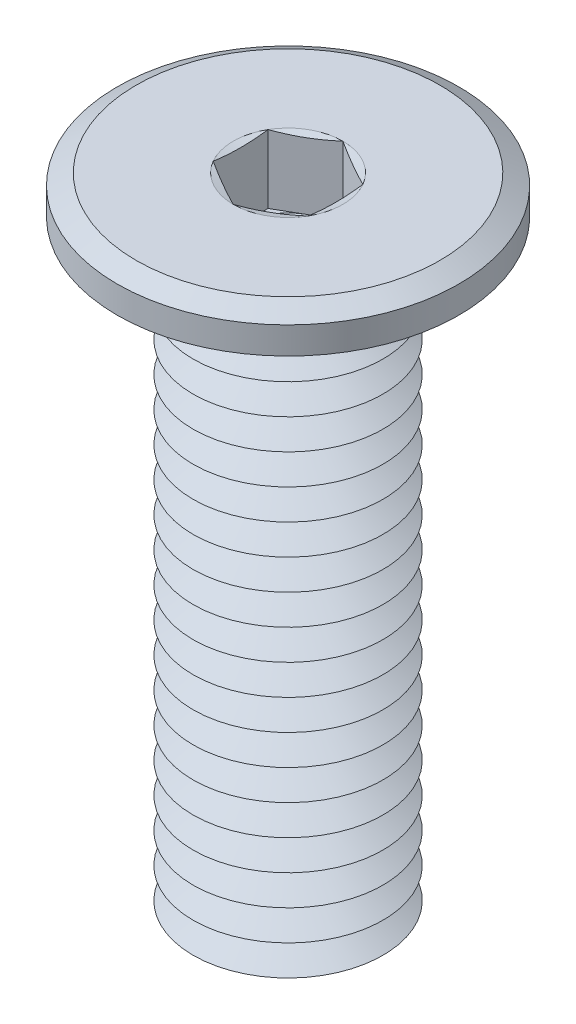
ISO-10303-21;
HEADER;
FILE_DESCRIPTION(('STEP AP214'),'2;1');
FILE_NAME('part.step','',(''),(''),'','','');
FILE_SCHEMA(('AUTOMOTIVE_DESIGN { 1 0 10303 214 1 1 1 1 }'));
ENDSEC;
DATA;
#1=APPLICATION_CONTEXT('core data for automotive mechanical design processes');
#2=APPLICATION_PROTOCOL_DEFINITION('international standard','automotive_design',2000,#1);
#3=PRODUCT_CONTEXT('',#1,'mechanical');
#4=PRODUCT('Part','Part','',(#3));
#5=PRODUCT_RELATED_PRODUCT_CATEGORY('part','',(#4));
#6=PRODUCT_DEFINITION_FORMATION('','',#4);
#7=PRODUCT_DEFINITION_CONTEXT('part definition',#1,'design');
#8=PRODUCT_DEFINITION('design','',#6,#7);
#9=PRODUCT_DEFINITION_SHAPE('','',#8);
#10=(LENGTH_UNIT() NAMED_UNIT(*) SI_UNIT(.MILLI.,.METRE.));
#11=(NAMED_UNIT(*) PLANE_ANGLE_UNIT() SI_UNIT($,.RADIAN.));
#12=(NAMED_UNIT(*) SI_UNIT($,.STERADIAN.) SOLID_ANGLE_UNIT());
#13=UNCERTAINTY_MEASURE_WITH_UNIT(LENGTH_MEASURE(1.E-05),#10,'distance_accuracy_value','');
#14=(GEOMETRIC_REPRESENTATION_CONTEXT(3) GLOBAL_UNCERTAINTY_ASSIGNED_CONTEXT((#13)) GLOBAL_UNIT_ASSIGNED_CONTEXT((#10,
#11,#12)) REPRESENTATION_CONTEXT('',''));
#15=CARTESIAN_POINT('',(0.,0.,0.));
#16=DIRECTION('',(0.,0.,1.));
#17=DIRECTION('',(1.,0.,0.));
#18=AXIS2_PLACEMENT_3D('',#15,#16,#17);
#19=CARTESIAN_POINT('',(0.,-15.8,0.));
#20=DIRECTION('',(0.,-1.,0.));
#21=DIRECTION('',(0.,0.,-1.));
#22=AXIS2_PLACEMENT_3D('',#19,#20,#21);
#23=CONICAL_SURFACE('',#22,2.5,1.0471975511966);
#24=CARTESIAN_POINT('',(0.,-15.4,0.));
#25=DIRECTION('',(0.,1.,0.));
#26=DIRECTION('',(0.,0.,1.));
#27=AXIS2_PLACEMENT_3D('',#24,#25,#26);
#28=CIRCLE('',#27,1.80717967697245);
#29=CARTESIAN_POINT('',(0.,-15.4,1.80717967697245));
#30=VERTEX_POINT('',#29);
#31=EDGE_CURVE('E503',#30,#30,#28,.T.);
#32=ORIENTED_EDGE('',*,*,#31,.F.);
#33=EDGE_LOOP('',(#32));
#34=FACE_BOUND('',#33,.T.);
#35=CARTESIAN_POINT('',(0.,-15.8,0.));
#36=DIRECTION('',(0.,1.,0.));
#37=DIRECTION('',(0.,0.,1.));
#38=AXIS2_PLACEMENT_3D('',#35,#36,#37);
#39=CIRCLE('',#38,2.5);
#40=CARTESIAN_POINT('',(0.,-15.8,2.5));
#41=VERTEX_POINT('',#40);
#42=EDGE_CURVE('E507',#41,#41,#39,.T.);
#43=ORIENTED_EDGE('',*,*,#42,.T.);
#44=EDGE_LOOP('',(#43));
#45=FACE_BOUND('',#44,.T.);
#46=ADVANCED_FACE('F39',(#34,#45),#23,.T.);
#47=CARTESIAN_POINT('',(0.,-15.4,0.));
#48=DIRECTION('',(0.,1.,0.));
#49=DIRECTION('',(0.,0.,1.));
#50=AXIS2_PLACEMENT_3D('',#47,#48,#49);
#51=CONICAL_SURFACE('',#50,1.80717967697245,1.0471975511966);
#52=CARTESIAN_POINT('',(0.,-15.,0.));
#53=DIRECTION('',(0.,1.,0.));
#54=DIRECTION('',(0.,0.,1.));
#55=AXIS2_PLACEMENT_3D('',#52,#53,#54);
#56=CIRCLE('',#55,2.5);
#57=CARTESIAN_POINT('',(0.,-15.,2.5));
#58=VERTEX_POINT('',#57);
#59=EDGE_CURVE('E499',#58,#58,#56,.T.);
#60=ORIENTED_EDGE('',*,*,#59,.F.);
#61=EDGE_LOOP('',(#60));
#62=FACE_BOUND('',#61,.T.);
#63=ORIENTED_EDGE('',*,*,#31,.T.);
#64=EDGE_LOOP('',(#63));
#65=FACE_BOUND('',#64,.T.);
#66=ADVANCED_FACE('F233',(#62,#65),#51,.T.);
#67=CARTESIAN_POINT('',(0.,-17.,0.));
#68=DIRECTION('',(0.,-1.,0.));
#69=DIRECTION('',(0.,0.,-1.));
#70=AXIS2_PLACEMENT_3D('',#67,#68,#69);
#71=PLANE('',#70);
#72=CARTESIAN_POINT('',(0.,-17.,0.));
#73=DIRECTION('',(0.,1.,0.));
#74=DIRECTION('',(0.,0.,1.));
#75=AXIS2_PLACEMENT_3D('',#72,#73,#74);
#76=CIRCLE('',#75,1.80717967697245);
#77=CARTESIAN_POINT('',(0.,-17.,1.80717967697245));
#78=VERTEX_POINT('',#77);
#79=EDGE_CURVE('E300',#78,#78,#76,.T.);
#80=ORIENTED_EDGE('',*,*,#79,.F.);
#81=EDGE_LOOP('',(#80));
#82=FACE_BOUND('',#81,.T.);
#83=ADVANCED_FACE('F239',(#82),#71,.T.);
#84=CARTESIAN_POINT('',(0.,-17.,0.));
#85=DIRECTION('',(0.,1.,0.));
#86=DIRECTION('',(0.,0.,1.));
#87=AXIS2_PLACEMENT_3D('',#84,#85,#86);
#88=CONICAL_SURFACE('',#87,1.80717967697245,1.0471975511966);
#89=CARTESIAN_POINT('',(0.,-16.6,0.));
#90=DIRECTION('',(0.,1.,0.));
#91=DIRECTION('',(0.,0.,1.));
#92=AXIS2_PLACEMENT_3D('',#89,#90,#91);
#93=CIRCLE('',#92,2.5);
#94=CARTESIAN_POINT('',(0.,-16.6,2.5));
#95=VERTEX_POINT('',#94);
#96=EDGE_CURVE('E515',#95,#95,#93,.T.);
#97=ORIENTED_EDGE('',*,*,#96,.F.);
#98=EDGE_LOOP('',(#97));
#99=FACE_BOUND('',#98,.T.);
#100=ORIENTED_EDGE('',*,*,#79,.T.);
#101=EDGE_LOOP('',(#100));
#102=FACE_BOUND('',#101,.T.);
#103=ADVANCED_FACE('F254',(#99,#102),#88,.T.);
#104=CARTESIAN_POINT('',(0.,-16.6,0.));
#105=DIRECTION('',(0.,-1.,0.));
#106=DIRECTION('',(0.,0.,-1.));
#107=AXIS2_PLACEMENT_3D('',#104,#105,#106);
#108=CONICAL_SURFACE('',#107,2.5,1.0471975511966);
#109=CARTESIAN_POINT('',(0.,-16.2,0.));
#110=DIRECTION('',(0.,1.,0.));
#111=DIRECTION('',(0.,0.,1.));
#112=AXIS2_PLACEMENT_3D('',#109,#110,#111);
#113=CIRCLE('',#112,1.80717967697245);
#114=CARTESIAN_POINT('',(0.,-16.2,1.80717967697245));
#115=VERTEX_POINT('',#114);
#116=EDGE_CURVE('E511',#115,#115,#113,.T.);
#117=ORIENTED_EDGE('',*,*,#116,.F.);
#118=EDGE_LOOP('',(#117));
#119=FACE_BOUND('',#118,.T.);
#120=ORIENTED_EDGE('',*,*,#96,.T.);
#121=EDGE_LOOP('',(#120));
#122=FACE_BOUND('',#121,.T.);
#123=ADVANCED_FACE('F250',(#119,#122),#108,.T.);
#124=CARTESIAN_POINT('',(0.,-16.2,0.));
#125=DIRECTION('',(0.,1.,0.));
#126=DIRECTION('',(0.,0.,1.));
#127=AXIS2_PLACEMENT_3D('',#124,#125,#126);
#128=CONICAL_SURFACE('',#127,1.80717967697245,1.0471975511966);
#129=ORIENTED_EDGE('',*,*,#42,.F.);
#130=EDGE_LOOP('',(#129));
#131=FACE_BOUND('',#130,.T.);
#132=ORIENTED_EDGE('',*,*,#116,.T.);
#133=EDGE_LOOP('',(#132));
#134=FACE_BOUND('',#133,.T.);
#135=ADVANCED_FACE('F246',(#131,#134),#128,.T.);
#136=CARTESIAN_POINT('',(0.,-15.,0.));
#137=DIRECTION('',(0.,-1.,0.));
#138=DIRECTION('',(0.,0.,-1.));
#139=AXIS2_PLACEMENT_3D('',#136,#137,#138);
#140=CONICAL_SURFACE('',#139,2.5,1.0471975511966);
#141=CARTESIAN_POINT('',(0.,-14.6,0.));
#142=DIRECTION('',(0.,1.,0.));
#143=DIRECTION('',(0.,0.,1.));
#144=AXIS2_PLACEMENT_3D('',#141,#142,#143);
#145=CIRCLE('',#144,1.80717967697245);
#146=CARTESIAN_POINT('',(0.,-14.6,1.80717967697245));
#147=VERTEX_POINT('',#146);
#148=EDGE_CURVE('E495',#147,#147,#145,.T.);
#149=ORIENTED_EDGE('',*,*,#148,.F.);
#150=EDGE_LOOP('',(#149));
#151=FACE_BOUND('',#150,.T.);
#152=ORIENTED_EDGE('',*,*,#59,.T.);
#153=EDGE_LOOP('',(#152));
#154=FACE_BOUND('',#153,.T.);
#155=ADVANCED_FACE('F249',(#151,#154),#140,.T.);
#156=CARTESIAN_POINT('',(0.,-14.6,0.));
#157=DIRECTION('',(0.,1.,0.));
#158=DIRECTION('',(0.,0.,1.));
#159=AXIS2_PLACEMENT_3D('',#156,#157,#158);
#160=CONICAL_SURFACE('',#159,1.80717967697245,1.0471975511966);
#161=CARTESIAN_POINT('',(0.,-14.2,0.));
#162=DIRECTION('',(0.,1.,0.));
#163=DIRECTION('',(0.,0.,1.));
#164=AXIS2_PLACEMENT_3D('',#161,#162,#163);
#165=CIRCLE('',#164,2.5);
#166=CARTESIAN_POINT('',(0.,-14.2,2.5));
#167=VERTEX_POINT('',#166);
#168=EDGE_CURVE('E491',#167,#167,#165,.T.);
#169=ORIENTED_EDGE('',*,*,#168,.F.);
#170=EDGE_LOOP('',(#169));
#171=FACE_BOUND('',#170,.T.);
#172=ORIENTED_EDGE('',*,*,#148,.T.);
#173=EDGE_LOOP('',(#172));
#174=FACE_BOUND('',#173,.T.);
#175=ADVANCED_FACE('F700',(#171,#174),#160,.T.);
#176=CARTESIAN_POINT('',(0.,-14.2,0.));
#177=DIRECTION('',(0.,-1.,0.));
#178=DIRECTION('',(0.,0.,-1.));
#179=AXIS2_PLACEMENT_3D('',#176,#177,#178);
#180=CONICAL_SURFACE('',#179,2.5,1.0471975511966);
#181=CARTESIAN_POINT('',(0.,-13.8,0.));
#182=DIRECTION('',(0.,1.,0.));
#183=DIRECTION('',(0.,0.,1.));
#184=AXIS2_PLACEMENT_3D('',#181,#182,#183);
#185=CIRCLE('',#184,1.80717967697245);
#186=CARTESIAN_POINT('',(0.,-13.8,1.80717967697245));
#187=VERTEX_POINT('',#186);
#188=EDGE_CURVE('E487',#187,#187,#185,.T.);
#189=ORIENTED_EDGE('',*,*,#188,.F.);
#190=EDGE_LOOP('',(#189));
#191=FACE_BOUND('',#190,.T.);
#192=ORIENTED_EDGE('',*,*,#168,.T.);
#193=EDGE_LOOP('',(#192));
#194=FACE_BOUND('',#193,.T.);
#195=ADVANCED_FACE('F696',(#191,#194),#180,.T.);
#196=CARTESIAN_POINT('',(0.,-13.8,0.));
#197=DIRECTION('',(0.,1.,0.));
#198=DIRECTION('',(0.,0.,1.));
#199=AXIS2_PLACEMENT_3D('',#196,#197,#198);
#200=CONICAL_SURFACE('',#199,1.80717967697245,1.0471975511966);
#201=CARTESIAN_POINT('',(0.,-13.4,0.));
#202=DIRECTION('',(0.,1.,0.));
#203=DIRECTION('',(0.,0.,1.));
#204=AXIS2_PLACEMENT_3D('',#201,#202,#203);
#205=CIRCLE('',#204,2.5);
#206=CARTESIAN_POINT('',(0.,-13.4,2.5));
#207=VERTEX_POINT('',#206);
#208=EDGE_CURVE('E483',#207,#207,#205,.T.);
#209=ORIENTED_EDGE('',*,*,#208,.F.);
#210=EDGE_LOOP('',(#209));
#211=FACE_BOUND('',#210,.T.);
#212=ORIENTED_EDGE('',*,*,#188,.T.);
#213=EDGE_LOOP('',(#212));
#214=FACE_BOUND('',#213,.T.);
#215=ADVANCED_FACE('F692',(#211,#214),#200,.T.);
#216=CARTESIAN_POINT('',(0.,-13.4,0.));
#217=DIRECTION('',(0.,-1.,0.));
#218=DIRECTION('',(0.,0.,-1.));
#219=AXIS2_PLACEMENT_3D('',#216,#217,#218);
#220=CONICAL_SURFACE('',#219,2.5,1.0471975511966);
#221=CARTESIAN_POINT('',(0.,-13.,0.));
#222=DIRECTION('',(0.,1.,0.));
#223=DIRECTION('',(0.,0.,1.));
#224=AXIS2_PLACEMENT_3D('',#221,#222,#223);
#225=CIRCLE('',#224,1.80717967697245);
#226=CARTESIAN_POINT('',(0.,-13.,1.80717967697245));
#227=VERTEX_POINT('',#226);
#228=EDGE_CURVE('E479',#227,#227,#225,.T.);
#229=ORIENTED_EDGE('',*,*,#228,.F.);
#230=EDGE_LOOP('',(#229));
#231=FACE_BOUND('',#230,.T.);
#232=ORIENTED_EDGE('',*,*,#208,.T.);
#233=EDGE_LOOP('',(#232));
#234=FACE_BOUND('',#233,.T.);
#235=ADVANCED_FACE('F688',(#231,#234),#220,.T.);
#236=CARTESIAN_POINT('',(0.,-13.,0.));
#237=DIRECTION('',(0.,1.,0.));
#238=DIRECTION('',(0.,0.,1.));
#239=AXIS2_PLACEMENT_3D('',#236,#237,#238);
#240=CONICAL_SURFACE('',#239,1.80717967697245,1.0471975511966);
#241=CARTESIAN_POINT('',(0.,-12.6,0.));
#242=DIRECTION('',(0.,1.,0.));
#243=DIRECTION('',(0.,0.,1.));
#244=AXIS2_PLACEMENT_3D('',#241,#242,#243);
#245=CIRCLE('',#244,2.5);
#246=CARTESIAN_POINT('',(0.,-12.6,2.5));
#247=VERTEX_POINT('',#246);
#248=EDGE_CURVE('E476',#247,#247,#245,.T.);
#249=ORIENTED_EDGE('',*,*,#248,.F.);
#250=EDGE_LOOP('',(#249));
#251=FACE_BOUND('',#250,.T.);
#252=ORIENTED_EDGE('',*,*,#228,.T.);
#253=EDGE_LOOP('',(#252));
#254=FACE_BOUND('',#253,.T.);
#255=ADVANCED_FACE('F684',(#251,#254),#240,.T.);
#256=CARTESIAN_POINT('',(0.,-12.6,0.));
#257=DIRECTION('',(0.,-1.,0.));
#258=DIRECTION('',(0.,0.,-1.));
#259=AXIS2_PLACEMENT_3D('',#256,#257,#258);
#260=CONICAL_SURFACE('',#259,2.5,1.0471975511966);
#261=CARTESIAN_POINT('',(0.,-12.2,0.));
#262=DIRECTION('',(0.,1.,0.));
#263=DIRECTION('',(0.,0.,1.));
#264=AXIS2_PLACEMENT_3D('',#261,#262,#263);
#265=CIRCLE('',#264,1.80717967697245);
#266=CARTESIAN_POINT('',(0.,-12.2,1.80717967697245));
#267=VERTEX_POINT('',#266);
#268=EDGE_CURVE('E473',#267,#267,#265,.T.);
#269=ORIENTED_EDGE('',*,*,#268,.F.);
#270=EDGE_LOOP('',(#269));
#271=FACE_BOUND('',#270,.T.);
#272=ORIENTED_EDGE('',*,*,#248,.T.);
#273=EDGE_LOOP('',(#272));
#274=FACE_BOUND('',#273,.T.);
#275=ADVANCED_FACE('F680',(#271,#274),#260,.T.);
#276=CARTESIAN_POINT('',(0.,-12.2,0.));
#277=DIRECTION('',(0.,1.,0.));
#278=DIRECTION('',(0.,0.,1.));
#279=AXIS2_PLACEMENT_3D('',#276,#277,#278);
#280=CONICAL_SURFACE('',#279,1.80717967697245,1.0471975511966);
#281=CARTESIAN_POINT('',(0.,-11.8,0.));
#282=DIRECTION('',(0.,1.,0.));
#283=DIRECTION('',(0.,0.,1.));
#284=AXIS2_PLACEMENT_3D('',#281,#282,#283);
#285=CIRCLE('',#284,2.5);
#286=CARTESIAN_POINT('',(0.,-11.8,2.5));
#287=VERTEX_POINT('',#286);
#288=EDGE_CURVE('E470',#287,#287,#285,.T.);
#289=ORIENTED_EDGE('',*,*,#288,.F.);
#290=EDGE_LOOP('',(#289));
#291=FACE_BOUND('',#290,.T.);
#292=ORIENTED_EDGE('',*,*,#268,.T.);
#293=EDGE_LOOP('',(#292));
#294=FACE_BOUND('',#293,.T.);
#295=ADVANCED_FACE('F676',(#291,#294),#280,.T.);
#296=CARTESIAN_POINT('',(0.,-11.8,0.));
#297=DIRECTION('',(0.,-1.,0.));
#298=DIRECTION('',(0.,0.,-1.));
#299=AXIS2_PLACEMENT_3D('',#296,#297,#298);
#300=CONICAL_SURFACE('',#299,2.5,1.0471975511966);
#301=CARTESIAN_POINT('',(0.,-11.4,0.));
#302=DIRECTION('',(0.,1.,0.));
#303=DIRECTION('',(0.,0.,1.));
#304=AXIS2_PLACEMENT_3D('',#301,#302,#303);
#305=CIRCLE('',#304,1.80717967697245);
#306=CARTESIAN_POINT('',(0.,-11.4,1.80717967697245));
#307=VERTEX_POINT('',#306);
#308=EDGE_CURVE('E466',#307,#307,#305,.T.);
#309=ORIENTED_EDGE('',*,*,#308,.F.);
#310=EDGE_LOOP('',(#309));
#311=FACE_BOUND('',#310,.T.);
#312=ORIENTED_EDGE('',*,*,#288,.T.);
#313=EDGE_LOOP('',(#312));
#314=FACE_BOUND('',#313,.T.);
#315=ADVANCED_FACE('F672',(#311,#314),#300,.T.);
#316=CARTESIAN_POINT('',(0.,-11.4,0.));
#317=DIRECTION('',(0.,1.,0.));
#318=DIRECTION('',(0.,0.,1.));
#319=AXIS2_PLACEMENT_3D('',#316,#317,#318);
#320=CONICAL_SURFACE('',#319,1.80717967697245,1.0471975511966);
#321=CARTESIAN_POINT('',(0.,-11.,0.));
#322=DIRECTION('',(0.,1.,0.));
#323=DIRECTION('',(0.,0.,1.));
#324=AXIS2_PLACEMENT_3D('',#321,#322,#323);
#325=CIRCLE('',#324,2.5);
#326=CARTESIAN_POINT('',(0.,-11.,2.5));
#327=VERTEX_POINT('',#326);
#328=EDGE_CURVE('E462',#327,#327,#325,.T.);
#329=ORIENTED_EDGE('',*,*,#328,.F.);
#330=EDGE_LOOP('',(#329));
#331=FACE_BOUND('',#330,.T.);
#332=ORIENTED_EDGE('',*,*,#308,.T.);
#333=EDGE_LOOP('',(#332));
#334=FACE_BOUND('',#333,.T.);
#335=ADVANCED_FACE('F668',(#331,#334),#320,.T.);
#336=CARTESIAN_POINT('',(0.,-11.,0.));
#337=DIRECTION('',(0.,-1.,0.));
#338=DIRECTION('',(0.,0.,-1.));
#339=AXIS2_PLACEMENT_3D('',#336,#337,#338);
#340=CONICAL_SURFACE('',#339,2.5,1.0471975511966);
#341=CARTESIAN_POINT('',(0.,-10.6,0.));
#342=DIRECTION('',(0.,1.,0.));
#343=DIRECTION('',(0.,0.,1.));
#344=AXIS2_PLACEMENT_3D('',#341,#342,#343);
#345=CIRCLE('',#344,1.80717967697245);
#346=CARTESIAN_POINT('',(0.,-10.6,1.80717967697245));
#347=VERTEX_POINT('',#346);
#348=EDGE_CURVE('E458',#347,#347,#345,.T.);
#349=ORIENTED_EDGE('',*,*,#348,.F.);
#350=EDGE_LOOP('',(#349));
#351=FACE_BOUND('',#350,.T.);
#352=ORIENTED_EDGE('',*,*,#328,.T.);
#353=EDGE_LOOP('',(#352));
#354=FACE_BOUND('',#353,.T.);
#355=ADVANCED_FACE('F664',(#351,#354),#340,.T.);
#356=CARTESIAN_POINT('',(0.,-10.6,0.));
#357=DIRECTION('',(0.,1.,0.));
#358=DIRECTION('',(0.,0.,1.));
#359=AXIS2_PLACEMENT_3D('',#356,#357,#358);
#360=CONICAL_SURFACE('',#359,1.80717967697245,1.0471975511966);
#361=CARTESIAN_POINT('',(0.,-10.2,0.));
#362=DIRECTION('',(0.,1.,0.));
#363=DIRECTION('',(0.,0.,1.));
#364=AXIS2_PLACEMENT_3D('',#361,#362,#363);
#365=CIRCLE('',#364,2.5);
#366=CARTESIAN_POINT('',(0.,-10.2,2.5));
#367=VERTEX_POINT('',#366);
#368=EDGE_CURVE('E454',#367,#367,#365,.T.);
#369=ORIENTED_EDGE('',*,*,#368,.F.);
#370=EDGE_LOOP('',(#369));
#371=FACE_BOUND('',#370,.T.);
#372=ORIENTED_EDGE('',*,*,#348,.T.);
#373=EDGE_LOOP('',(#372));
#374=FACE_BOUND('',#373,.T.);
#375=ADVANCED_FACE('F660',(#371,#374),#360,.T.);
#376=CARTESIAN_POINT('',(0.,-10.2,0.));
#377=DIRECTION('',(0.,-1.,0.));
#378=DIRECTION('',(0.,0.,-1.));
#379=AXIS2_PLACEMENT_3D('',#376,#377,#378);
#380=CONICAL_SURFACE('',#379,2.5,1.0471975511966);
#381=CARTESIAN_POINT('',(0.,-9.8,0.));
#382=DIRECTION('',(0.,1.,0.));
#383=DIRECTION('',(0.,0.,1.));
#384=AXIS2_PLACEMENT_3D('',#381,#382,#383);
#385=CIRCLE('',#384,1.80717967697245);
#386=CARTESIAN_POINT('',(0.,-9.8,1.80717967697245));
#387=VERTEX_POINT('',#386);
#388=EDGE_CURVE('E450',#387,#387,#385,.T.);
#389=ORIENTED_EDGE('',*,*,#388,.F.);
#390=EDGE_LOOP('',(#389));
#391=FACE_BOUND('',#390,.T.);
#392=ORIENTED_EDGE('',*,*,#368,.T.);
#393=EDGE_LOOP('',(#392));
#394=FACE_BOUND('',#393,.T.);
#395=ADVANCED_FACE('F656',(#391,#394),#380,.T.);
#396=CARTESIAN_POINT('',(0.,-9.8,0.));
#397=DIRECTION('',(0.,1.,0.));
#398=DIRECTION('',(0.,0.,1.));
#399=AXIS2_PLACEMENT_3D('',#396,#397,#398);
#400=CONICAL_SURFACE('',#399,1.80717967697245,1.0471975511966);
#401=CARTESIAN_POINT('',(0.,-9.4,0.));
#402=DIRECTION('',(0.,1.,0.));
#403=DIRECTION('',(0.,0.,1.));
#404=AXIS2_PLACEMENT_3D('',#401,#402,#403);
#405=CIRCLE('',#404,2.5);
#406=CARTESIAN_POINT('',(0.,-9.4,2.5));
#407=VERTEX_POINT('',#406);
#408=EDGE_CURVE('E446',#407,#407,#405,.T.);
#409=ORIENTED_EDGE('',*,*,#408,.F.);
#410=EDGE_LOOP('',(#409));
#411=FACE_BOUND('',#410,.T.);
#412=ORIENTED_EDGE('',*,*,#388,.T.);
#413=EDGE_LOOP('',(#412));
#414=FACE_BOUND('',#413,.T.);
#415=ADVANCED_FACE('F652',(#411,#414),#400,.T.);
#416=CARTESIAN_POINT('',(0.,-9.4,0.));
#417=DIRECTION('',(0.,-1.,0.));
#418=DIRECTION('',(0.,0.,-1.));
#419=AXIS2_PLACEMENT_3D('',#416,#417,#418);
#420=CONICAL_SURFACE('',#419,2.5,1.0471975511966);
#421=CARTESIAN_POINT('',(0.,-9.,0.));
#422=DIRECTION('',(0.,1.,0.));
#423=DIRECTION('',(0.,0.,1.));
#424=AXIS2_PLACEMENT_3D('',#421,#422,#423);
#425=CIRCLE('',#424,1.80717967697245);
#426=CARTESIAN_POINT('',(0.,-9.,1.80717967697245));
#427=VERTEX_POINT('',#426);
#428=EDGE_CURVE('E442',#427,#427,#425,.T.);
#429=ORIENTED_EDGE('',*,*,#428,.F.);
#430=EDGE_LOOP('',(#429));
#431=FACE_BOUND('',#430,.T.);
#432=ORIENTED_EDGE('',*,*,#408,.T.);
#433=EDGE_LOOP('',(#432));
#434=FACE_BOUND('',#433,.T.);
#435=ADVANCED_FACE('F648',(#431,#434),#420,.T.);
#436=CARTESIAN_POINT('',(0.,-9.,0.));
#437=DIRECTION('',(0.,1.,0.));
#438=DIRECTION('',(0.,0.,1.));
#439=AXIS2_PLACEMENT_3D('',#436,#437,#438);
#440=CONICAL_SURFACE('',#439,1.80717967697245,1.0471975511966);
#441=CARTESIAN_POINT('',(0.,-8.6,0.));
#442=DIRECTION('',(0.,1.,0.));
#443=DIRECTION('',(0.,0.,1.));
#444=AXIS2_PLACEMENT_3D('',#441,#442,#443);
#445=CIRCLE('',#444,2.5);
#446=CARTESIAN_POINT('',(0.,-8.6,2.5));
#447=VERTEX_POINT('',#446);
#448=EDGE_CURVE('E438',#447,#447,#445,.T.);
#449=ORIENTED_EDGE('',*,*,#448,.F.);
#450=EDGE_LOOP('',(#449));
#451=FACE_BOUND('',#450,.T.);
#452=ORIENTED_EDGE('',*,*,#428,.T.);
#453=EDGE_LOOP('',(#452));
#454=FACE_BOUND('',#453,.T.);
#455=ADVANCED_FACE('F644',(#451,#454),#440,.T.);
#456=CARTESIAN_POINT('',(0.,-8.6,0.));
#457=DIRECTION('',(0.,-1.,0.));
#458=DIRECTION('',(0.,0.,-1.));
#459=AXIS2_PLACEMENT_3D('',#456,#457,#458);
#460=CONICAL_SURFACE('',#459,2.5,1.0471975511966);
#461=CARTESIAN_POINT('',(0.,-8.2,0.));
#462=DIRECTION('',(0.,1.,0.));
#463=DIRECTION('',(0.,0.,1.));
#464=AXIS2_PLACEMENT_3D('',#461,#462,#463);
#465=CIRCLE('',#464,1.80717967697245);
#466=CARTESIAN_POINT('',(0.,-8.2,1.80717967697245));
#467=VERTEX_POINT('',#466);
#468=EDGE_CURVE('E434',#467,#467,#465,.T.);
#469=ORIENTED_EDGE('',*,*,#468,.F.);
#470=EDGE_LOOP('',(#469));
#471=FACE_BOUND('',#470,.T.);
#472=ORIENTED_EDGE('',*,*,#448,.T.);
#473=EDGE_LOOP('',(#472));
#474=FACE_BOUND('',#473,.T.);
#475=ADVANCED_FACE('F640',(#471,#474),#460,.T.);
#476=CARTESIAN_POINT('',(0.,-8.2,0.));
#477=DIRECTION('',(0.,1.,0.));
#478=DIRECTION('',(0.,0.,1.));
#479=AXIS2_PLACEMENT_3D('',#476,#477,#478);
#480=CONICAL_SURFACE('',#479,1.80717967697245,1.0471975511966);
#481=CARTESIAN_POINT('',(0.,-7.8,0.));
#482=DIRECTION('',(0.,1.,0.));
#483=DIRECTION('',(0.,0.,1.));
#484=AXIS2_PLACEMENT_3D('',#481,#482,#483);
#485=CIRCLE('',#484,2.5);
#486=CARTESIAN_POINT('',(0.,-7.8,2.5));
#487=VERTEX_POINT('',#486);
#488=EDGE_CURVE('E430',#487,#487,#485,.T.);
#489=ORIENTED_EDGE('',*,*,#488,.F.);
#490=EDGE_LOOP('',(#489));
#491=FACE_BOUND('',#490,.T.);
#492=ORIENTED_EDGE('',*,*,#468,.T.);
#493=EDGE_LOOP('',(#492));
#494=FACE_BOUND('',#493,.T.);
#495=ADVANCED_FACE('F636',(#491,#494),#480,.T.);
#496=CARTESIAN_POINT('',(0.,-7.8,0.));
#497=DIRECTION('',(0.,-1.,0.));
#498=DIRECTION('',(0.,0.,-1.));
#499=AXIS2_PLACEMENT_3D('',#496,#497,#498);
#500=CONICAL_SURFACE('',#499,2.5,1.0471975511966);
#501=CARTESIAN_POINT('',(0.,-7.4,0.));
#502=DIRECTION('',(0.,1.,0.));
#503=DIRECTION('',(0.,0.,1.));
#504=AXIS2_PLACEMENT_3D('',#501,#502,#503);
#505=CIRCLE('',#504,1.80717967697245);
#506=CARTESIAN_POINT('',(0.,-7.4,1.80717967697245));
#507=VERTEX_POINT('',#506);
#508=EDGE_CURVE('E427',#507,#507,#505,.T.);
#509=ORIENTED_EDGE('',*,*,#508,.F.);
#510=EDGE_LOOP('',(#509));
#511=FACE_BOUND('',#510,.T.);
#512=ORIENTED_EDGE('',*,*,#488,.T.);
#513=EDGE_LOOP('',(#512));
#514=FACE_BOUND('',#513,.T.);
#515=ADVANCED_FACE('F632',(#511,#514),#500,.T.);
#516=CARTESIAN_POINT('',(0.,-7.4,0.));
#517=DIRECTION('',(0.,1.,0.));
#518=DIRECTION('',(0.,0.,1.));
#519=AXIS2_PLACEMENT_3D('',#516,#517,#518);
#520=CONICAL_SURFACE('',#519,1.80717967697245,1.0471975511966);
#521=CARTESIAN_POINT('',(0.,-7.,0.));
#522=DIRECTION('',(0.,1.,0.));
#523=DIRECTION('',(0.,0.,1.));
#524=AXIS2_PLACEMENT_3D('',#521,#522,#523);
#525=CIRCLE('',#524,2.5);
#526=CARTESIAN_POINT('',(0.,-7.,2.5));
#527=VERTEX_POINT('',#526);
#528=EDGE_CURVE('E424',#527,#527,#525,.T.);
#529=ORIENTED_EDGE('',*,*,#528,.F.);
#530=EDGE_LOOP('',(#529));
#531=FACE_BOUND('',#530,.T.);
#532=ORIENTED_EDGE('',*,*,#508,.T.);
#533=EDGE_LOOP('',(#532));
#534=FACE_BOUND('',#533,.T.);
#535=ADVANCED_FACE('F628',(#531,#534),#520,.T.);
#536=CARTESIAN_POINT('',(0.,-7.,0.));
#537=DIRECTION('',(0.,-1.,0.));
#538=DIRECTION('',(0.,0.,-1.));
#539=AXIS2_PLACEMENT_3D('',#536,#537,#538);
#540=CONICAL_SURFACE('',#539,2.5,1.0471975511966);
#541=CARTESIAN_POINT('',(0.,-6.6,0.));
#542=DIRECTION('',(0.,1.,0.));
#543=DIRECTION('',(0.,0.,1.));
#544=AXIS2_PLACEMENT_3D('',#541,#542,#543);
#545=CIRCLE('',#544,1.80717967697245);
#546=CARTESIAN_POINT('',(0.,-6.6,1.80717967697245));
#547=VERTEX_POINT('',#546);
#548=EDGE_CURVE('E420',#547,#547,#545,.T.);
#549=ORIENTED_EDGE('',*,*,#548,.F.);
#550=EDGE_LOOP('',(#549));
#551=FACE_BOUND('',#550,.T.);
#552=ORIENTED_EDGE('',*,*,#528,.T.);
#553=EDGE_LOOP('',(#552));
#554=FACE_BOUND('',#553,.T.);
#555=ADVANCED_FACE('F624',(#551,#554),#540,.T.);
#556=CARTESIAN_POINT('',(0.,-6.6,0.));
#557=DIRECTION('',(0.,1.,0.));
#558=DIRECTION('',(0.,0.,1.));
#559=AXIS2_PLACEMENT_3D('',#556,#557,#558);
#560=CONICAL_SURFACE('',#559,1.80717967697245,1.0471975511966);
#561=CARTESIAN_POINT('',(0.,-6.2,0.));
#562=DIRECTION('',(0.,1.,0.));
#563=DIRECTION('',(0.,0.,1.));
#564=AXIS2_PLACEMENT_3D('',#561,#562,#563);
#565=CIRCLE('',#564,2.5);
#566=CARTESIAN_POINT('',(0.,-6.2,2.5));
#567=VERTEX_POINT('',#566);
#568=EDGE_CURVE('E416',#567,#567,#565,.T.);
#569=ORIENTED_EDGE('',*,*,#568,.F.);
#570=EDGE_LOOP('',(#569));
#571=FACE_BOUND('',#570,.T.);
#572=ORIENTED_EDGE('',*,*,#548,.T.);
#573=EDGE_LOOP('',(#572));
#574=FACE_BOUND('',#573,.T.);
#575=ADVANCED_FACE('F620',(#571,#574),#560,.T.);
#576=CARTESIAN_POINT('',(0.,-6.2,0.));
#577=DIRECTION('',(0.,-1.,0.));
#578=DIRECTION('',(0.,0.,-1.));
#579=AXIS2_PLACEMENT_3D('',#576,#577,#578);
#580=CONICAL_SURFACE('',#579,2.5,1.0471975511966);
#581=CARTESIAN_POINT('',(0.,-5.8,0.));
#582=DIRECTION('',(0.,1.,0.));
#583=DIRECTION('',(0.,0.,1.));
#584=AXIS2_PLACEMENT_3D('',#581,#582,#583);
#585=CIRCLE('',#584,1.80717967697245);
#586=CARTESIAN_POINT('',(0.,-5.8,1.80717967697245));
#587=VERTEX_POINT('',#586);
#588=EDGE_CURVE('E412',#587,#587,#585,.T.);
#589=ORIENTED_EDGE('',*,*,#588,.F.);
#590=EDGE_LOOP('',(#589));
#591=FACE_BOUND('',#590,.T.);
#592=ORIENTED_EDGE('',*,*,#568,.T.);
#593=EDGE_LOOP('',(#592));
#594=FACE_BOUND('',#593,.T.);
#595=ADVANCED_FACE('F616',(#591,#594),#580,.T.);
#596=CARTESIAN_POINT('',(0.,-5.8,0.));
#597=DIRECTION('',(0.,1.,0.));
#598=DIRECTION('',(0.,0.,1.));
#599=AXIS2_PLACEMENT_3D('',#596,#597,#598);
#600=CONICAL_SURFACE('',#599,1.80717967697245,1.0471975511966);
#601=CARTESIAN_POINT('',(0.,-5.4,0.));
#602=DIRECTION('',(0.,1.,0.));
#603=DIRECTION('',(0.,0.,1.));
#604=AXIS2_PLACEMENT_3D('',#601,#602,#603);
#605=CIRCLE('',#604,2.5);
#606=CARTESIAN_POINT('',(0.,-5.4,2.5));
#607=VERTEX_POINT('',#606);
#608=EDGE_CURVE('E409',#607,#607,#605,.T.);
#609=ORIENTED_EDGE('',*,*,#608,.F.);
#610=EDGE_LOOP('',(#609));
#611=FACE_BOUND('',#610,.T.);
#612=ORIENTED_EDGE('',*,*,#588,.T.);
#613=EDGE_LOOP('',(#612));
#614=FACE_BOUND('',#613,.T.);
#615=ADVANCED_FACE('F612',(#611,#614),#600,.T.);
#616=CARTESIAN_POINT('',(0.,-5.4,0.));
#617=DIRECTION('',(0.,-1.,0.));
#618=DIRECTION('',(0.,0.,-1.));
#619=AXIS2_PLACEMENT_3D('',#616,#617,#618);
#620=CONICAL_SURFACE('',#619,2.5,1.0471975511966);
#621=CARTESIAN_POINT('',(0.,-5.,0.));
#622=DIRECTION('',(0.,1.,0.));
#623=DIRECTION('',(0.,0.,1.));
#624=AXIS2_PLACEMENT_3D('',#621,#622,#623);
#625=CIRCLE('',#624,1.80717967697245);
#626=CARTESIAN_POINT('',(0.,-5.,1.80717967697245));
#627=VERTEX_POINT('',#626);
#628=EDGE_CURVE('E405',#627,#627,#625,.T.);
#629=ORIENTED_EDGE('',*,*,#628,.F.);
#630=EDGE_LOOP('',(#629));
#631=FACE_BOUND('',#630,.T.);
#632=ORIENTED_EDGE('',*,*,#608,.T.);
#633=EDGE_LOOP('',(#632));
#634=FACE_BOUND('',#633,.T.);
#635=ADVANCED_FACE('F608',(#631,#634),#620,.T.);
#636=CARTESIAN_POINT('',(0.,-5.,0.));
#637=DIRECTION('',(0.,1.,0.));
#638=DIRECTION('',(0.,0.,1.));
#639=AXIS2_PLACEMENT_3D('',#636,#637,#638);
#640=CONICAL_SURFACE('',#639,1.80717967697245,1.0471975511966);
#641=CARTESIAN_POINT('',(0.,-4.6,0.));
#642=DIRECTION('',(0.,1.,0.));
#643=DIRECTION('',(0.,0.,1.));
#644=AXIS2_PLACEMENT_3D('',#641,#642,#643);
#645=CIRCLE('',#644,2.5);
#646=CARTESIAN_POINT('',(0.,-4.6,2.5));
#647=VERTEX_POINT('',#646);
#648=EDGE_CURVE('E401',#647,#647,#645,.T.);
#649=ORIENTED_EDGE('',*,*,#648,.F.);
#650=EDGE_LOOP('',(#649));
#651=FACE_BOUND('',#650,.T.);
#652=ORIENTED_EDGE('',*,*,#628,.T.);
#653=EDGE_LOOP('',(#652));
#654=FACE_BOUND('',#653,.T.);
#655=ADVANCED_FACE('F604',(#651,#654),#640,.T.);
#656=CARTESIAN_POINT('',(0.,-4.6,0.));
#657=DIRECTION('',(0.,-1.,0.));
#658=DIRECTION('',(0.,0.,-1.));
#659=AXIS2_PLACEMENT_3D('',#656,#657,#658);
#660=CONICAL_SURFACE('',#659,2.5,1.0471975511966);
#661=CARTESIAN_POINT('',(0.,-4.2,0.));
#662=DIRECTION('',(0.,1.,0.));
#663=DIRECTION('',(0.,0.,1.));
#664=AXIS2_PLACEMENT_3D('',#661,#662,#663);
#665=CIRCLE('',#664,1.80717967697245);
#666=CARTESIAN_POINT('',(0.,-4.2,1.80717967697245));
#667=VERTEX_POINT('',#666);
#668=EDGE_CURVE('E397',#667,#667,#665,.T.);
#669=ORIENTED_EDGE('',*,*,#668,.F.);
#670=EDGE_LOOP('',(#669));
#671=FACE_BOUND('',#670,.T.);
#672=ORIENTED_EDGE('',*,*,#648,.T.);
#673=EDGE_LOOP('',(#672));
#674=FACE_BOUND('',#673,.T.);
#675=ADVANCED_FACE('F600',(#671,#674),#660,.T.);
#676=CARTESIAN_POINT('',(0.,-4.2,0.));
#677=DIRECTION('',(0.,1.,0.));
#678=DIRECTION('',(0.,0.,1.));
#679=AXIS2_PLACEMENT_3D('',#676,#677,#678);
#680=CONICAL_SURFACE('',#679,1.80717967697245,1.0471975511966);
#681=CARTESIAN_POINT('',(0.,-3.8,0.));
#682=DIRECTION('',(0.,1.,0.));
#683=DIRECTION('',(0.,0.,1.));
#684=AXIS2_PLACEMENT_3D('',#681,#682,#683);
#685=CIRCLE('',#684,2.5);
#686=CARTESIAN_POINT('',(0.,-3.8,2.5));
#687=VERTEX_POINT('',#686);
#688=EDGE_CURVE('E394',#687,#687,#685,.T.);
#689=ORIENTED_EDGE('',*,*,#688,.F.);
#690=EDGE_LOOP('',(#689));
#691=FACE_BOUND('',#690,.T.);
#692=ORIENTED_EDGE('',*,*,#668,.T.);
#693=EDGE_LOOP('',(#692));
#694=FACE_BOUND('',#693,.T.);
#695=ADVANCED_FACE('F596',(#691,#694),#680,.T.);
#696=CARTESIAN_POINT('',(0.,-3.8,0.));
#697=DIRECTION('',(0.,-1.,0.));
#698=DIRECTION('',(0.,0.,-1.));
#699=AXIS2_PLACEMENT_3D('',#696,#697,#698);
#700=CONICAL_SURFACE('',#699,2.5,1.0471975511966);
#701=CARTESIAN_POINT('',(0.,-3.4,0.));
#702=DIRECTION('',(0.,1.,0.));
#703=DIRECTION('',(0.,0.,1.));
#704=AXIS2_PLACEMENT_3D('',#701,#702,#703);
#705=CIRCLE('',#704,1.80717967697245);
#706=CARTESIAN_POINT('',(0.,-3.4,1.80717967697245));
#707=VERTEX_POINT('',#706);
#708=EDGE_CURVE('E390',#707,#707,#705,.T.);
#709=ORIENTED_EDGE('',*,*,#708,.F.);
#710=EDGE_LOOP('',(#709));
#711=FACE_BOUND('',#710,.T.);
#712=ORIENTED_EDGE('',*,*,#688,.T.);
#713=EDGE_LOOP('',(#712));
#714=FACE_BOUND('',#713,.T.);
#715=ADVANCED_FACE('F592',(#711,#714),#700,.T.);
#716=CARTESIAN_POINT('',(0.,-3.4,0.));
#717=DIRECTION('',(0.,1.,0.));
#718=DIRECTION('',(0.,0.,1.));
#719=AXIS2_PLACEMENT_3D('',#716,#717,#718);
#720=CONICAL_SURFACE('',#719,1.80717967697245,1.0471975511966);
#721=CARTESIAN_POINT('',(0.,-3.,0.));
#722=DIRECTION('',(0.,1.,0.));
#723=DIRECTION('',(0.,0.,1.));
#724=AXIS2_PLACEMENT_3D('',#721,#722,#723);
#725=CIRCLE('',#724,2.5);
#726=CARTESIAN_POINT('',(0.,-3.,2.5));
#727=VERTEX_POINT('',#726);
#728=EDGE_CURVE('E386',#727,#727,#725,.T.);
#729=ORIENTED_EDGE('',*,*,#728,.F.);
#730=EDGE_LOOP('',(#729));
#731=FACE_BOUND('',#730,.T.);
#732=ORIENTED_EDGE('',*,*,#708,.T.);
#733=EDGE_LOOP('',(#732));
#734=FACE_BOUND('',#733,.T.);
#735=ADVANCED_FACE('F588',(#731,#734),#720,.T.);
#736=CARTESIAN_POINT('',(0.,-3.,0.));
#737=DIRECTION('',(0.,-1.,0.));
#738=DIRECTION('',(0.,0.,-1.));
#739=AXIS2_PLACEMENT_3D('',#736,#737,#738);
#740=CONICAL_SURFACE('',#739,2.5,1.0471975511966);
#741=CARTESIAN_POINT('',(0.,-2.6,0.));
#742=DIRECTION('',(0.,1.,0.));
#743=DIRECTION('',(0.,0.,1.));
#744=AXIS2_PLACEMENT_3D('',#741,#742,#743);
#745=CIRCLE('',#744,1.80717967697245);
#746=CARTESIAN_POINT('',(0.,-2.6,1.80717967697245));
#747=VERTEX_POINT('',#746);
#748=EDGE_CURVE('E382',#747,#747,#745,.T.);
#749=ORIENTED_EDGE('',*,*,#748,.F.);
#750=EDGE_LOOP('',(#749));
#751=FACE_BOUND('',#750,.T.);
#752=ORIENTED_EDGE('',*,*,#728,.T.);
#753=EDGE_LOOP('',(#752));
#754=FACE_BOUND('',#753,.T.);
#755=ADVANCED_FACE('F584',(#751,#754),#740,.T.);
#756=CARTESIAN_POINT('',(0.,-2.6,0.));
#757=DIRECTION('',(0.,1.,0.));
#758=DIRECTION('',(0.,0.,1.));
#759=AXIS2_PLACEMENT_3D('',#756,#757,#758);
#760=CONICAL_SURFACE('',#759,1.80717967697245,1.0471975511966);
#761=CARTESIAN_POINT('',(0.,-2.2,0.));
#762=DIRECTION('',(0.,1.,0.));
#763=DIRECTION('',(0.,0.,1.));
#764=AXIS2_PLACEMENT_3D('',#761,#762,#763);
#765=CIRCLE('',#764,2.5);
#766=CARTESIAN_POINT('',(0.,-2.2,2.5));
#767=VERTEX_POINT('',#766);
#768=EDGE_CURVE('E367',#767,#767,#765,.T.);
#769=ORIENTED_EDGE('',*,*,#768,.F.);
#770=EDGE_LOOP('',(#769));
#771=FACE_BOUND('',#770,.T.);
#772=ORIENTED_EDGE('',*,*,#748,.T.);
#773=EDGE_LOOP('',(#772));
#774=FACE_BOUND('',#773,.T.);
#775=ADVANCED_FACE('F274',(#771,#774),#760,.T.);
#776=CARTESIAN_POINT('',(0.,0.,0.));
#777=DIRECTION('',(0.,1.,0.));
#778=DIRECTION('',(0.,0.,1.));
#779=AXIS2_PLACEMENT_3D('',#776,#777,#778);
#780=PLANE('',#779);
#781=CARTESIAN_POINT('',(0.,0.,0.));
#782=DIRECTION('',(0.,1.,0.));
#783=DIRECTION('',(0.,0.,1.));
#784=AXIS2_PLACEMENT_3D('',#781,#782,#783);
#785=CIRCLE('',#784,1.44337567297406);
#786=CARTESIAN_POINT('',(0.,0.,1.44337567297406));
#787=VERTEX_POINT('',#786);
#788=CARTESIAN_POINT('',(1.25,0.,0.721687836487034));
#789=VERTEX_POINT('',#788);
#790=EDGE_CURVE('E66',#787,#789,#785,.T.);
#791=ORIENTED_EDGE('',*,*,#790,.F.);
#792=CARTESIAN_POINT('',(-1.25,0.,0.721687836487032));
#793=VERTEX_POINT('',#792);
#794=EDGE_CURVE('E169',#793,#787,#785,.T.);
#795=ORIENTED_EDGE('',*,*,#794,.F.);
#796=CARTESIAN_POINT('',(-1.25,0.,-0.721687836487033));
#797=VERTEX_POINT('',#796);
#798=EDGE_CURVE('E164',#797,#793,#785,.T.);
#799=ORIENTED_EDGE('',*,*,#798,.F.);
#800=CARTESIAN_POINT('',(0.,0.,-1.44337567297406));
#801=VERTEX_POINT('',#800);
#802=EDGE_CURVE('E128',#801,#797,#785,.T.);
#803=ORIENTED_EDGE('',*,*,#802,.F.);
#804=CARTESIAN_POINT('',(1.25,0.,-0.721687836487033));
#805=VERTEX_POINT('',#804);
#806=EDGE_CURVE('E119',#805,#801,#785,.T.);
#807=ORIENTED_EDGE('',*,*,#806,.F.);
#808=EDGE_CURVE('E59',#789,#805,#785,.T.);
#809=ORIENTED_EDGE('',*,*,#808,.F.);
#810=EDGE_LOOP('',(#791,#795,#799,#803,#807,#809));
#811=FACE_BOUND('',#810,.T.);
#812=CARTESIAN_POINT('',(0.,0.,0.));
#813=DIRECTION('',(0.,1.,0.));
#814=DIRECTION('',(0.,0.,1.));
#815=AXIS2_PLACEMENT_3D('',#812,#813,#814);
#816=CIRCLE('',#815,4.);
#817=CARTESIAN_POINT('',(0.,0.,4.));
#818=VERTEX_POINT('',#817);
#819=EDGE_CURVE('E296',#818,#818,#816,.T.);
#820=ORIENTED_EDGE('',*,*,#819,.T.);
#821=EDGE_LOOP('',(#820));
#822=FACE_BOUND('',#821,.T.);
#823=ADVANCED_FACE('F160',(#811,#822),#780,.T.);
#824=CARTESIAN_POINT('',(0.,-1.,0.));
#825=DIRECTION('',(0.,1.,0.));
#826=DIRECTION('',(0.,0.,1.));
#827=AXIS2_PLACEMENT_3D('',#824,#825,#826);
#828=CYLINDRICAL_SURFACE('',#827,4.5);
#829=CARTESIAN_POINT('',(0.,-0.288675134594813,0.));
#830=DIRECTION('',(0.,1.,0.));
#831=DIRECTION('',(0.,0.,1.));
#832=AXIS2_PLACEMENT_3D('',#829,#830,#831);
#833=CIRCLE('',#832,4.5);
#834=CARTESIAN_POINT('',(0.,-0.288675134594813,4.5));
#835=VERTEX_POINT('',#834);
#836=EDGE_CURVE('E307',#835,#835,#833,.F.);
#837=ORIENTED_EDGE('',*,*,#836,.T.);
#838=EDGE_LOOP('',(#837));
#839=FACE_BOUND('',#838,.T.);
#840=CARTESIAN_POINT('',(0.,-1.,0.));
#841=DIRECTION('',(0.,1.,0.));
#842=DIRECTION('',(0.,0.,1.));
#843=AXIS2_PLACEMENT_3D('',#840,#841,#842);
#844=CIRCLE('',#843,4.5);
#845=CARTESIAN_POINT('',(0.,-1.,4.5));
#846=VERTEX_POINT('',#845);
#847=EDGE_CURVE('E291',#846,#846,#844,.T.);
#848=ORIENTED_EDGE('',*,*,#847,.T.);
#849=EDGE_LOOP('',(#848));
#850=FACE_BOUND('',#849,.T.);
#851=ADVANCED_FACE('F270',(#839,#850),#828,.T.);
#852=CARTESIAN_POINT('',(0.,-1.,0.));
#853=DIRECTION('',(0.,1.,0.));
#854=DIRECTION('',(0.,0.,1.));
#855=AXIS2_PLACEMENT_3D('',#852,#853,#854);
#856=PLANE('',#855);
#857=CARTESIAN_POINT('',(0.,-1.,0.));
#858=DIRECTION('',(0.,1.,0.));
#859=DIRECTION('',(0.,0.,1.));
#860=AXIS2_PLACEMENT_3D('',#857,#858,#859);
#861=CIRCLE('',#860,2.7);
#862=CARTESIAN_POINT('',(0.,-1.,2.7));
#863=VERTEX_POINT('',#862);
#864=EDGE_CURVE('E286',#863,#863,#861,.T.);
#865=ORIENTED_EDGE('',*,*,#864,.T.);
#866=EDGE_LOOP('',(#865));
#867=FACE_BOUND('',#866,.T.);
#868=ORIENTED_EDGE('',*,*,#847,.F.);
#869=EDGE_LOOP('',(#868));
#870=FACE_BOUND('',#869,.T.);
#871=ADVANCED_FACE('F266',(#867,#870),#856,.F.);
#872=CARTESIAN_POINT('',(0.,-17.,0.));
#873=DIRECTION('',(0.,1.,0.));
#874=DIRECTION('',(0.,0.,1.));
#875=AXIS2_PLACEMENT_3D('',#872,#873,#874);
#876=CYLINDRICAL_SURFACE('',#875,2.5);
#877=CARTESIAN_POINT('',(0.,-1.2,0.));
#878=DIRECTION('',(0.,1.,0.));
#879=DIRECTION('',(0.,0.,1.));
#880=AXIS2_PLACEMENT_3D('',#877,#878,#879);
#881=CIRCLE('',#880,2.5);
#882=CARTESIAN_POINT('',(0.,-1.2,2.5));
#883=VERTEX_POINT('',#882);
#884=EDGE_CURVE('E289',#883,#883,#881,.F.);
#885=ORIENTED_EDGE('',*,*,#884,.T.);
#886=EDGE_LOOP('',(#885));
#887=FACE_BOUND('',#886,.T.);
#888=ORIENTED_EDGE('',*,*,#768,.T.);
#889=EDGE_LOOP('',(#888));
#890=FACE_BOUND('',#889,.T.);
#891=ADVANCED_FACE('F262',(#887,#890),#876,.T.);
#892=CARTESIAN_POINT('',(0.,-1.2,0.));
#893=DIRECTION('',(0.,1.,0.));
#894=DIRECTION('',(0.,0.,1.));
#895=AXIS2_PLACEMENT_3D('',#892,#893,#894);
#896=TOROIDAL_SURFACE('',#895,2.7,0.2);
#897=ORIENTED_EDGE('',*,*,#864,.F.);
#898=EDGE_LOOP('',(#897));
#899=FACE_BOUND('',#898,.T.);
#900=ORIENTED_EDGE('',*,*,#884,.F.);
#901=EDGE_LOOP('',(#900));
#902=FACE_BOUND('',#901,.T.);
#903=ADVANCED_FACE('F265',(#899,#902),#896,.F.);
#904=CARTESIAN_POINT('',(0.,0.,0.));
#905=DIRECTION('',(0.,-1.,0.));
#906=DIRECTION('',(0.,0.,-1.));
#907=AXIS2_PLACEMENT_3D('',#904,#905,#906);
#908=CONICAL_SURFACE('',#907,4.,1.0471975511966);
#909=ORIENTED_EDGE('',*,*,#836,.F.);
#910=EDGE_LOOP('',(#909));
#911=FACE_BOUND('',#910,.T.);
#912=ORIENTED_EDGE('',*,*,#819,.F.);
#913=EDGE_LOOP('',(#912));
#914=FACE_BOUND('',#913,.T.);
#915=ADVANCED_FACE('F41',(#911,#914),#908,.T.);
#916=CARTESIAN_POINT('',(0.,0.,0.));
#917=DIRECTION('',(0.,1.,0.));
#918=DIRECTION('',(0.,0.,1.));
#919=AXIS2_PLACEMENT_3D('',#916,#917,#918);
#920=CONICAL_SURFACE('',#919,1.44337567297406,1.30899693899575);
#921=ORIENTED_EDGE('',*,*,#802,.T.);
#922=CARTESIAN_POINT('',(0.000200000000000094,3.09438201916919E-05,-1.4434911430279));
#923=CARTESIAN_POINT('',(-0.0517259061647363,-0.00800698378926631,-1.41351170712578));
#924=CARTESIAN_POINT('',(-0.103745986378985,-0.0153042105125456,-1.38347789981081));
#925=CARTESIAN_POINT('',(-0.207969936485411,-0.028124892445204,-1.32330417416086));
#926=CARTESIAN_POINT('',(-0.260173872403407,-0.0336476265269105,-1.29316421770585));
#927=CARTESIAN_POINT('',(-0.36444888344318,-0.0425967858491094,-1.23296101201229));
#928=CARTESIAN_POINT('',(-0.416519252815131,-0.0460338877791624,-1.20289817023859));
#929=CARTESIAN_POINT('',(-0.520726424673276,-0.0506427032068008,-1.1427341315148));
#930=CARTESIAN_POINT('',(-0.572863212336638,-0.0518148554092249,-1.11263294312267));
#931=CARTESIAN_POINT('',(-0.677136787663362,-0.0518148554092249,-1.05243056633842));
#932=CARTESIAN_POINT('',(-0.729273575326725,-0.0506427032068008,-1.0223293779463));
#933=CARTESIAN_POINT('',(-0.833480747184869,-0.0460338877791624,-0.96216533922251));
#934=CARTESIAN_POINT('',(-0.88555111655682,-0.0425967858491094,-0.932102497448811));
#935=CARTESIAN_POINT('',(-0.989826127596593,-0.0336476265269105,-0.871899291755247));
#936=CARTESIAN_POINT('',(-1.04203006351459,-0.028124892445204,-0.841759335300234));
#937=CARTESIAN_POINT('',(-1.14625401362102,-0.0153042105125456,-0.781585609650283));
#938=CARTESIAN_POINT('',(-1.19827409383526,-0.0080069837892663,-0.75155180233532));
#939=CARTESIAN_POINT('',(-1.2502,3.09438201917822E-05,-0.721572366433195));
#940=B_SPLINE_CURVE_WITH_KNOTS('',3,(#922,#923,#924,#925,#926,#927,#928,#929,#930,#931,#932,
#933,#934,#935,#936,#937,#938,#939),.UNSPECIFIED.,.F.,.F.,(4,2,2,2,2,2,2,2,4),(0.,
0.18149525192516,0.363064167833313,0.543695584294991,0.724292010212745,0.9048884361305,
1.08551985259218,1.26708876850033,1.44858402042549),.UNSPECIFIED.);
#941=EDGE_CURVE('E11',#801,#797,#940,.T.);
#942=ORIENTED_EDGE('',*,*,#941,.F.);
#943=EDGE_LOOP('',(#921,#942));
#944=FACE_BOUND('',#943,.T.);
#945=ADVANCED_FACE('F132',(#944),#920,.F.);
#946=ORIENTED_EDGE('',*,*,#798,.T.);
#947=CARTESIAN_POINT('',(-1.25,0.295017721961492,-2.21618029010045));
#948=CARTESIAN_POINT('',(-1.25,0.270123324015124,-2.10936606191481));
#949=CARTESIAN_POINT('',(-1.25,0.245578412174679,-2.00246488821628));
#950=CARTESIAN_POINT('',(-1.25,0.197670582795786,-1.78837821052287));
#951=CARTESIAN_POINT('',(-1.25,0.174307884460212,-1.68119265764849));
#952=CARTESIAN_POINT('',(-1.25,0.129037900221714,-1.46542158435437));
#953=CARTESIAN_POINT('',(-1.25,0.107146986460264,-1.35683258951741));
#954=CARTESIAN_POINT('',(-1.25,0.0659326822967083,-1.13914880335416));
#955=CARTESIAN_POINT('',(-1.25,0.0466095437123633,-1.03005396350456));
#956=CARTESIAN_POINT('',(-1.25,0.0123179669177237,-0.814238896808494));
#957=CARTESIAN_POINT('',(-1.25,-0.00275558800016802,-0.707535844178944));
#958=CARTESIAN_POINT('',(-1.25,-0.0275791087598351,-0.493517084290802));
#959=CARTESIAN_POINT('',(-1.25,-0.0373307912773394,-0.386201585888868));
#960=CARTESIAN_POINT('',(-1.25,-0.0498256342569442,-0.171630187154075));
#961=CARTESIAN_POINT('',(-1.25,-0.052600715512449,-0.064376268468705));
#962=CARTESIAN_POINT('',(-1.25,-0.0506356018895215,0.15006745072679));
#963=CARTESIAN_POINT('',(-1.25,-0.0458948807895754,0.257257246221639));
#964=CARTESIAN_POINT('',(-1.25,-0.032096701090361,0.441548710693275));
#965=CARTESIAN_POINT('',(-1.25,-0.0245948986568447,0.518776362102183));
#966=CARTESIAN_POINT('',(-1.25,-0.00682363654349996,0.672906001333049));
#967=CARTESIAN_POINT('',(-1.25,0.003445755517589,0.749807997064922));
#968=CARTESIAN_POINT('',(-1.25,0.0261652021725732,0.903544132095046));
#969=CARTESIAN_POINT('',(-1.25,0.0386223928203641,0.980377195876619));
#970=CARTESIAN_POINT('',(-1.25,0.0651615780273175,1.13376313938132));
#971=CARTESIAN_POINT('',(-1.25,0.0792436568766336,1.21031600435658));
#972=CARTESIAN_POINT('',(-1.25,0.108934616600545,1.36480056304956));
#973=CARTESIAN_POINT('',(-1.25,0.124569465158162,1.44272722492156));
#974=CARTESIAN_POINT('',(-1.25,0.156788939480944,1.59838383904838));
#975=CARTESIAN_POINT('',(-1.25,0.173373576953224,1.67611378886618));
#976=CARTESIAN_POINT('',(-1.25,0.2071623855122,1.83097242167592));
#977=CARTESIAN_POINT('',(-1.25,0.224362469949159,1.90810200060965));
#978=CARTESIAN_POINT('',(-1.25,0.259314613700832,2.06223034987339));
#979=CARTESIAN_POINT('',(-1.25,0.277066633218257,2.13922912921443));
#980=CARTESIAN_POINT('',(-1.25,0.295017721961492,2.21618029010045));
#981=B_SPLINE_CURVE_WITH_KNOTS('',3,(#947,#948,#949,#950,#951,#952,#953,#954,#955,#956,#957,
#958,#959,#960,#961,#962,#963,#964,#965,#966,#967,#968,#969,#970,#971,#972,#973,#974,#975,#976,
#977,#978,#979,#980),.UNSPECIFIED.,.F.,.F.,(4,2,2,2,2,2,2,2,2,2,2,2,2,2,2,2,4),(0.,
0.329038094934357,0.658136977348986,0.990437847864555,1.32277128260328,1.64596801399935,
1.96906043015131,2.29067185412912,2.61230579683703,2.84502466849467,3.07773785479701,
3.31122468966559,3.54472364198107,3.78315484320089,4.0215889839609,4.2586591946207,
4.49571235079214),.UNSPECIFIED.);
#982=EDGE_CURVE('E172',#797,#793,#981,.T.);
#983=ORIENTED_EDGE('',*,*,#982,.F.);
#984=EDGE_LOOP('',(#946,#983));
#985=FACE_BOUND('',#984,.T.);
#986=ADVANCED_FACE('F836',(#985),#920,.F.);
#987=ORIENTED_EDGE('',*,*,#794,.T.);
#988=CARTESIAN_POINT('',(-1.2502,3.09438201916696E-05,0.721572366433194));
#989=CARTESIAN_POINT('',(-1.19827409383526,-0.00800698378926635,0.75155180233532));
#990=CARTESIAN_POINT('',(-1.14625401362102,-0.0153042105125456,0.781585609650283));
#991=CARTESIAN_POINT('',(-1.04203006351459,-0.0281248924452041,0.841759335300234));
#992=CARTESIAN_POINT('',(-0.989826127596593,-0.0336476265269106,0.871899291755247));
#993=CARTESIAN_POINT('',(-0.88555111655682,-0.0425967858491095,0.932102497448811));
#994=CARTESIAN_POINT('',(-0.833480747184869,-0.0460338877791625,0.96216533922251));
#995=CARTESIAN_POINT('',(-0.729273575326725,-0.0506427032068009,1.0223293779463));
#996=CARTESIAN_POINT('',(-0.677136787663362,-0.051814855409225,1.05243056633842));
#997=CARTESIAN_POINT('',(-0.572863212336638,-0.051814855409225,1.11263294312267));
#998=CARTESIAN_POINT('',(-0.520726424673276,-0.0506427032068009,1.1427341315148));
#999=CARTESIAN_POINT('',(-0.416519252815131,-0.0460338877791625,1.20289817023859));
#1000=CARTESIAN_POINT('',(-0.36444888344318,-0.0425967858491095,1.23296101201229));
#1001=CARTESIAN_POINT('',(-0.260173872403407,-0.0336476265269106,1.29316421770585));
#1002=CARTESIAN_POINT('',(-0.207969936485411,-0.0281248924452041,1.32330417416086));
#1003=CARTESIAN_POINT('',(-0.103745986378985,-0.0153042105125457,1.38347789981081));
#1004=CARTESIAN_POINT('',(-0.0517259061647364,-0.00800698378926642,1.41351170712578));
#1005=CARTESIAN_POINT('',(0.000199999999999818,3.09438201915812E-05,1.4434911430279));
#1006=B_SPLINE_CURVE_WITH_KNOTS('',3,(#988,#989,#990,#991,#992,#993,#994,#995,#996,#997,#998,
#999,#1000,#1001,#1002,#1003,#1004,#1005),.UNSPECIFIED.,.F.,.F.,(4,2,2,2,2,2,2,2,4),(0.,
0.18149525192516,0.363064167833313,0.543695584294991,0.724292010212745,0.9048884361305,
1.08551985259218,1.26708876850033,1.44858402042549),.UNSPECIFIED.);
#1007=EDGE_CURVE('E180',#793,#787,#1006,.T.);
#1008=ORIENTED_EDGE('',*,*,#1007,.F.);
#1009=EDGE_LOOP('',(#987,#1008));
#1010=FACE_BOUND('',#1009,.T.);
#1011=ADVANCED_FACE('F542',(#1010),#920,.F.);
#1012=ORIENTED_EDGE('',*,*,#790,.T.);
#1013=CARTESIAN_POINT('',(-0.000200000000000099,3.09438201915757E-05,1.4434911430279));
#1014=CARTESIAN_POINT('',(0.0517259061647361,-0.00800698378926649,1.41351170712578));
#1015=CARTESIAN_POINT('',(0.103745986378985,-0.0153042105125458,1.38347789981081));
#1016=CARTESIAN_POINT('',(0.207969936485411,-0.0281248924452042,1.32330417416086));
#1017=CARTESIAN_POINT('',(0.260173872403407,-0.0336476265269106,1.29316421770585));
#1018=CARTESIAN_POINT('',(0.36444888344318,-0.0425967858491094,1.23296101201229));
#1019=CARTESIAN_POINT('',(0.416519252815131,-0.0460338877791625,1.20289817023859));
#1020=CARTESIAN_POINT('',(0.520726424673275,-0.0506427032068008,1.1427341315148));
#1021=CARTESIAN_POINT('',(0.572863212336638,-0.0518148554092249,1.11263294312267));
#1022=CARTESIAN_POINT('',(0.677136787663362,-0.0518148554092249,1.05243056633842));
#1023=CARTESIAN_POINT('',(0.729273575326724,-0.0506427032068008,1.0223293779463));
#1024=CARTESIAN_POINT('',(0.833480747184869,-0.0460338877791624,0.96216533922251));
#1025=CARTESIAN_POINT('',(0.88555111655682,-0.0425967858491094,0.932102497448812));
#1026=CARTESIAN_POINT('',(0.989826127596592,-0.0336476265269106,0.871899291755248));
#1027=CARTESIAN_POINT('',(1.04203006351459,-0.0281248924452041,0.841759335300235));
#1028=CARTESIAN_POINT('',(1.14625401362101,-0.0153042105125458,0.781585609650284));
#1029=CARTESIAN_POINT('',(1.19827409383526,-0.00800698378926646,0.751551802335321));
#1030=CARTESIAN_POINT('',(1.2502,3.09438201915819E-05,0.721572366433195));
#1031=B_SPLINE_CURVE_WITH_KNOTS('',3,(#1013,#1014,#1015,#1016,#1017,#1018,#1019,#1020,#1021,
#1022,#1023,#1024,#1025,#1026,#1027,#1028,#1029,#1030),.UNSPECIFIED.,.F.,.F.,(4,2,2,2,2,2,2,2,
4),(0.,0.18149525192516,0.363064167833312,0.543695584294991,0.724292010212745,0.904888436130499,
1.08551985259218,1.26708876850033,1.44858402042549),.UNSPECIFIED.);
#1032=EDGE_CURVE('E199',#787,#789,#1031,.T.);
#1033=ORIENTED_EDGE('',*,*,#1032,.F.);
#1034=EDGE_LOOP('',(#1012,#1033));
#1035=FACE_BOUND('',#1034,.T.);
#1036=ADVANCED_FACE('F544',(#1035),#920,.F.);
#1037=ORIENTED_EDGE('',*,*,#808,.T.);
#1038=CARTESIAN_POINT('',(1.25,0.295017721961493,2.21618029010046));
#1039=CARTESIAN_POINT('',(1.25,0.270123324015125,2.10936606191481));
#1040=CARTESIAN_POINT('',(1.25,0.245578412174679,2.00246488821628));
#1041=CARTESIAN_POINT('',(1.25,0.197670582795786,1.78837821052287));
#1042=CARTESIAN_POINT('',(1.25,0.174307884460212,1.6811926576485));
#1043=CARTESIAN_POINT('',(1.25,0.129037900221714,1.46542158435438));
#1044=CARTESIAN_POINT('',(1.25,0.107146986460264,1.35683258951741));
#1045=CARTESIAN_POINT('',(1.25,0.0659326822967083,1.13914880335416));
#1046=CARTESIAN_POINT('',(1.25,0.0466095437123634,1.03005396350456));
#1047=CARTESIAN_POINT('',(1.25,0.0123179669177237,0.814238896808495));
#1048=CARTESIAN_POINT('',(1.25,-0.00275558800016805,0.707535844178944));
#1049=CARTESIAN_POINT('',(1.25,-0.0275791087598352,0.493517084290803));
#1050=CARTESIAN_POINT('',(1.25,-0.0373307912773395,0.386201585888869));
#1051=CARTESIAN_POINT('',(1.25,-0.0498256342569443,0.171630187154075));
#1052=CARTESIAN_POINT('',(1.25,-0.0526007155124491,0.0643762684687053));
#1053=CARTESIAN_POINT('',(1.25,-0.0506356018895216,-0.15006745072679));
#1054=CARTESIAN_POINT('',(1.25,-0.0458948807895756,-0.257257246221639));
#1055=CARTESIAN_POINT('',(1.25,-0.0320967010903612,-0.441548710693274));
#1056=CARTESIAN_POINT('',(1.25,-0.0245948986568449,-0.518776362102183));
#1057=CARTESIAN_POINT('',(1.25,-0.00682363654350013,-0.672906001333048));
#1058=CARTESIAN_POINT('',(1.25,0.00344575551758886,-0.749807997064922));
#1059=CARTESIAN_POINT('',(1.25,0.0261652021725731,-0.903544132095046));
#1060=CARTESIAN_POINT('',(1.25,0.038622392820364,-0.980377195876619));
#1061=CARTESIAN_POINT('',(1.25,0.0651615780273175,-1.13376313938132));
#1062=CARTESIAN_POINT('',(1.25,0.0792436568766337,-1.21031600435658));
#1063=CARTESIAN_POINT('',(1.25,0.108934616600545,-1.36480056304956));
#1064=CARTESIAN_POINT('',(1.25,0.124569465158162,-1.44272722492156));
#1065=CARTESIAN_POINT('',(1.25,0.156788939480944,-1.59838383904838));
#1066=CARTESIAN_POINT('',(1.25,0.173373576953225,-1.67611378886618));
#1067=CARTESIAN_POINT('',(1.25,0.2071623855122,-1.83097242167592));
#1068=CARTESIAN_POINT('',(1.25,0.224362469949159,-1.90810200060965));
#1069=CARTESIAN_POINT('',(1.25,0.259314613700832,-2.0622303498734));
#1070=CARTESIAN_POINT('',(1.25,0.277066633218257,-2.13922912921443));
#1071=CARTESIAN_POINT('',(1.25,0.295017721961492,-2.21618029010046));
#1072=B_SPLINE_CURVE_WITH_KNOTS('',3,(#1038,#1039,#1040,#1041,#1042,#1043,#1044,#1045,#1046,
#1047,#1048,#1049,#1050,#1051,#1052,#1053,#1054,#1055,#1056,#1057,#1058,#1059,#1060,#1061,#1062,
#1063,#1064,#1065,#1066,#1067,#1068,#1069,#1070,#1071),.UNSPECIFIED.,.F.,.F.,(4,2,2,2,2,2,2,2,2,
2,2,2,2,2,2,2,4),(0.,0.329038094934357,0.658136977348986,0.990437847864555,1.32277128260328,
1.64596801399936,1.96906043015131,2.29067185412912,2.61230579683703,2.84502466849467,
3.07773785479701,3.3112246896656,3.54472364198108,3.78315484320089,4.02158898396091,
4.2586591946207,4.49571235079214),.UNSPECIFIED.);
#1073=EDGE_CURVE('E149',#789,#805,#1072,.T.);
#1074=ORIENTED_EDGE('',*,*,#1073,.F.);
#1075=EDGE_LOOP('',(#1037,#1074));
#1076=FACE_BOUND('',#1075,.T.);
#1077=ADVANCED_FACE('F192',(#1076),#920,.F.);
#1078=ORIENTED_EDGE('',*,*,#806,.T.);
#1079=CARTESIAN_POINT('',(1.2502,3.09438201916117E-05,-0.721572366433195));
#1080=CARTESIAN_POINT('',(1.19827409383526,-0.00800698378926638,-0.751551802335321));
#1081=CARTESIAN_POINT('',(1.14625401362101,-0.0153042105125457,-0.781585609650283));
#1082=CARTESIAN_POINT('',(1.04203006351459,-0.0281248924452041,-0.841759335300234));
#1083=CARTESIAN_POINT('',(0.989826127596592,-0.0336476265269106,-0.871899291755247));
#1084=CARTESIAN_POINT('',(0.88555111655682,-0.0425967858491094,-0.932102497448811));
#1085=CARTESIAN_POINT('',(0.833480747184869,-0.0460338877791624,-0.96216533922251));
#1086=CARTESIAN_POINT('',(0.729273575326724,-0.0506427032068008,-1.0223293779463));
#1087=CARTESIAN_POINT('',(0.677136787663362,-0.0518148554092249,-1.05243056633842));
#1088=CARTESIAN_POINT('',(0.572863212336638,-0.0518148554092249,-1.11263294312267));
#1089=CARTESIAN_POINT('',(0.520726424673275,-0.0506427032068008,-1.1427341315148));
#1090=CARTESIAN_POINT('',(0.416519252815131,-0.0460338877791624,-1.20289817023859));
#1091=CARTESIAN_POINT('',(0.36444888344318,-0.0425967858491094,-1.23296101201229));
#1092=CARTESIAN_POINT('',(0.260173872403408,-0.0336476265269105,-1.29316421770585));
#1093=CARTESIAN_POINT('',(0.207969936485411,-0.028124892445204,-1.32330417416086));
#1094=CARTESIAN_POINT('',(0.103745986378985,-0.0153042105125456,-1.38347789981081));
#1095=CARTESIAN_POINT('',(0.0517259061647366,-0.00800698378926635,-1.41351170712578));
#1096=CARTESIAN_POINT('',(-0.000199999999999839,3.09438201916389E-05,-1.4434911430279));
#1097=B_SPLINE_CURVE_WITH_KNOTS('',3,(#1079,#1080,#1081,#1082,#1083,#1084,#1085,#1086,#1087,
#1088,#1089,#1090,#1091,#1092,#1093,#1094,#1095,#1096),.UNSPECIFIED.,.F.,.F.,(4,2,2,2,2,2,2,2,
4),(0.,0.18149525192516,0.363064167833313,0.543695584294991,0.724292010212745,0.904888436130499,
1.08551985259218,1.26708876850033,1.44858402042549),.UNSPECIFIED.);
#1098=EDGE_CURVE('E123',#805,#801,#1097,.T.);
#1099=ORIENTED_EDGE('',*,*,#1098,.F.);
#1100=EDGE_LOOP('',(#1078,#1099));
#1101=FACE_BOUND('',#1100,.T.);
#1102=ADVANCED_FACE('F121',(#1101),#920,.F.);
#1103=CARTESIAN_POINT('',(0.,-1.8,0.));
#1104=DIRECTION('',(0.,1.,0.));
#1105=DIRECTION('',(0.,0.,1.));
#1106=AXIS2_PLACEMENT_3D('',#1103,#1104,#1105);
#1107=CONICAL_SURFACE('',#1106,1.25,1.0471975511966);
#1108=CARTESIAN_POINT('',(0.,-2.52168783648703,0.));
#1109=VERTEX_POINT('',#1108);
#1110=VERTEX_LOOP('',#1109);
#1111=FACE_BOUND('',#1110,.T.);
#1112=CARTESIAN_POINT('',(0.,-1.8,0.));
#1113=DIRECTION('',(0.,1.,0.));
#1114=DIRECTION('',(0.,0.,1.));
#1115=AXIS2_PLACEMENT_3D('',#1112,#1113,#1114);
#1116=CIRCLE('',#1115,1.25);
#1117=CARTESIAN_POINT('',(0.624999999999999,-1.8,1.08253175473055));
#1118=VERTEX_POINT('',#1117);
#1119=CARTESIAN_POINT('',(1.25,-1.8,0.));
#1120=VERTEX_POINT('',#1119);
#1121=EDGE_CURVE('E148',#1118,#1120,#1116,.T.);
#1122=ORIENTED_EDGE('',*,*,#1121,.T.);
#1123=CARTESIAN_POINT('',(0.,-1.8,0.));
#1124=DIRECTION('',(0.,1.,0.));
#1125=DIRECTION('',(0.,0.,1.));
#1126=AXIS2_PLACEMENT_3D('',#1123,#1124,#1125);
#1127=CIRCLE('',#1126,1.25);
#1128=CARTESIAN_POINT('',(0.625,-1.8,-1.08253175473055));
#1129=VERTEX_POINT('',#1128);
#1130=EDGE_CURVE('E53',#1120,#1129,#1127,.T.);
#1131=ORIENTED_EDGE('',*,*,#1130,.T.);
#1132=CARTESIAN_POINT('',(-0.625,-1.8,-1.08253175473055));
#1133=VERTEX_POINT('',#1132);
#1134=EDGE_CURVE('E320',#1129,#1133,#1127,.T.);
#1135=ORIENTED_EDGE('',*,*,#1134,.T.);
#1136=CARTESIAN_POINT('',(-1.25,-1.8,0.));
#1137=VERTEX_POINT('',#1136);
#1138=EDGE_CURVE('E318',#1133,#1137,#1127,.T.);
#1139=ORIENTED_EDGE('',*,*,#1138,.T.);
#1140=CARTESIAN_POINT('',(-0.625,-1.8,1.08253175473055));
#1141=VERTEX_POINT('',#1140);
#1142=EDGE_CURVE('E312',#1137,#1141,#1127,.T.);
#1143=ORIENTED_EDGE('',*,*,#1142,.T.);
#1144=EDGE_CURVE('E310',#1141,#1118,#1127,.T.);
#1145=ORIENTED_EDGE('',*,*,#1144,.T.);
#1146=EDGE_LOOP('',(#1122,#1131,#1135,#1139,#1143,#1145));
#1147=FACE_BOUND('',#1146,.T.);
#1148=ADVANCED_FACE('F191',(#1111,#1147),#1107,.F.);
#1149=CARTESIAN_POINT('',(0.,-1.8,0.));
#1150=DIRECTION('',(0.,1.,0.));
#1151=DIRECTION('',(0.,0.,1.));
#1152=AXIS2_PLACEMENT_3D('',#1149,#1150,#1151);
#1153=PLANE('',#1152);
#1154=ORIENTED_EDGE('',*,*,#1130,.F.);
#1155=DIRECTION('',(0.,0.,-1.));
#1156=VECTOR('',#1155,1.);
#1157=CARTESIAN_POINT('',(1.25,-1.8,0.721687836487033));
#1158=LINE('',#1157,#1156);
#1159=CARTESIAN_POINT('',(1.25,-1.8,-0.721687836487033));
#1160=VERTEX_POINT('',#1159);
#1161=EDGE_CURVE('E362',#1120,#1160,#1158,.T.);
#1162=ORIENTED_EDGE('',*,*,#1161,.T.);
#1163=DIRECTION('',(-0.866025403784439,0.,-0.5));
#1164=VECTOR('',#1163,1.);
#1165=CARTESIAN_POINT('',(1.25,-1.8,-0.721687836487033));
#1166=LINE('',#1165,#1164);
#1167=EDGE_CURVE('E537',#1160,#1129,#1166,.T.);
#1168=ORIENTED_EDGE('',*,*,#1167,.T.);
#1169=EDGE_LOOP('',(#1154,#1162,#1168));
#1170=FACE_BOUND('',#1169,.T.);
#1171=ADVANCED_FACE('F556',(#1170),#1153,.T.);
#1172=ORIENTED_EDGE('',*,*,#1121,.F.);
#1173=DIRECTION('',(0.866025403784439,0.,-0.499999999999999));
#1174=VECTOR('',#1173,1.);
#1175=CARTESIAN_POINT('',(0.,-1.8,1.44337567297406));
#1176=LINE('',#1175,#1174);
#1177=CARTESIAN_POINT('',(1.25,-1.8,0.721687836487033));
#1178=VERTEX_POINT('',#1177);
#1179=EDGE_CURVE('E358',#1118,#1178,#1176,.T.);
#1180=ORIENTED_EDGE('',*,*,#1179,.T.);
#1181=EDGE_CURVE('E157',#1178,#1120,#1158,.T.);
#1182=ORIENTED_EDGE('',*,*,#1181,.T.);
#1183=EDGE_LOOP('',(#1172,#1180,#1182));
#1184=FACE_BOUND('',#1183,.T.);
#1185=ADVANCED_FACE('F528',(#1184),#1153,.T.);
#1186=ORIENTED_EDGE('',*,*,#1144,.F.);
#1187=DIRECTION('',(0.866025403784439,0.,0.5));
#1188=VECTOR('',#1187,1.);
#1189=CARTESIAN_POINT('',(-1.25,-1.8,0.721687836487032));
#1190=LINE('',#1189,#1188);
#1191=CARTESIAN_POINT('',(0.,-1.8,1.44337567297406));
#1192=VERTEX_POINT('',#1191);
#1193=EDGE_CURVE('E350',#1141,#1192,#1190,.T.);
#1194=ORIENTED_EDGE('',*,*,#1193,.T.);
#1195=EDGE_CURVE('E359',#1192,#1118,#1176,.T.);
#1196=ORIENTED_EDGE('',*,*,#1195,.T.);
#1197=EDGE_LOOP('',(#1186,#1194,#1196));
#1198=FACE_BOUND('',#1197,.T.);
#1199=ADVANCED_FACE('F220',(#1198),#1153,.T.);
#1200=ORIENTED_EDGE('',*,*,#1142,.F.);
#1201=DIRECTION('',(0.,0.,1.));
#1202=VECTOR('',#1201,1.);
#1203=CARTESIAN_POINT('',(-1.25,-1.8,-0.721687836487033));
#1204=LINE('',#1203,#1202);
#1205=CARTESIAN_POINT('',(-1.25,-1.8,0.721687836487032));
#1206=VERTEX_POINT('',#1205);
#1207=EDGE_CURVE('E338',#1137,#1206,#1204,.T.);
#1208=ORIENTED_EDGE('',*,*,#1207,.T.);
#1209=EDGE_CURVE('E341',#1206,#1141,#1190,.T.);
#1210=ORIENTED_EDGE('',*,*,#1209,.T.);
#1211=EDGE_LOOP('',(#1200,#1208,#1210));
#1212=FACE_BOUND('',#1211,.T.);
#1213=ADVANCED_FACE('F337',(#1212),#1153,.T.);
#1214=ORIENTED_EDGE('',*,*,#1134,.F.);
#1215=CARTESIAN_POINT('',(0.,-1.8,-1.44337567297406));
#1216=VERTEX_POINT('',#1215);
#1217=EDGE_CURVE('E539',#1129,#1216,#1166,.T.);
#1218=ORIENTED_EDGE('',*,*,#1217,.T.);
#1219=DIRECTION('',(-0.866025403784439,0.,0.5));
#1220=VECTOR('',#1219,1.);
#1221=CARTESIAN_POINT('',(0.,-1.8,-1.44337567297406));
#1222=LINE('',#1221,#1220);
#1223=EDGE_CURVE('E154',#1216,#1133,#1222,.T.);
#1224=ORIENTED_EDGE('',*,*,#1223,.T.);
#1225=EDGE_LOOP('',(#1214,#1218,#1224));
#1226=FACE_BOUND('',#1225,.T.);
#1227=ADVANCED_FACE('F555',(#1226),#1153,.T.);
#1228=ORIENTED_EDGE('',*,*,#1138,.F.);
#1229=CARTESIAN_POINT('',(-1.25,-1.8,-0.721687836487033));
#1230=VERTEX_POINT('',#1229);
#1231=EDGE_CURVE('E348',#1133,#1230,#1222,.T.);
#1232=ORIENTED_EDGE('',*,*,#1231,.T.);
#1233=EDGE_CURVE('E343',#1230,#1137,#1204,.T.);
#1234=ORIENTED_EDGE('',*,*,#1233,.T.);
#1235=EDGE_LOOP('',(#1228,#1232,#1234));
#1236=FACE_BOUND('',#1235,.T.);
#1237=ADVANCED_FACE('F347',(#1236),#1153,.T.);
#1238=CARTESIAN_POINT('',(0.,-1.8,-1.44337567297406));
#1239=DIRECTION('',(-0.5,0.,-0.866025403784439));
#1240=DIRECTION('',(-0.866025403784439,0.,0.5));
#1241=AXIS2_PLACEMENT_3D('',#1238,#1239,#1240);
#1242=PLANE('',#1241);
#1243=DIRECTION('',(0.,1.,0.));
#1244=VECTOR('',#1243,1.);
#1245=CARTESIAN_POINT('',(0.,-1.8,-1.44337567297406));
#1246=LINE('',#1245,#1244);
#1247=EDGE_CURVE('E142',#1216,#801,#1246,.T.);
#1248=ORIENTED_EDGE('',*,*,#1247,.T.);
#1249=ORIENTED_EDGE('',*,*,#941,.T.);
#1250=DIRECTION('',(0.,1.,0.));
#1251=VECTOR('',#1250,1.);
#1252=CARTESIAN_POINT('',(-1.25,-1.8,-0.721687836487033));
#1253=LINE('',#1252,#1251);
#1254=EDGE_CURVE('E156',#1230,#797,#1253,.T.);
#1255=ORIENTED_EDGE('',*,*,#1254,.F.);
#1256=ORIENTED_EDGE('',*,*,#1231,.F.);
#1257=ORIENTED_EDGE('',*,*,#1223,.F.);
#1258=EDGE_LOOP('',(#1248,#1249,#1255,#1256,#1257));
#1259=FACE_BOUND('',#1258,.T.);
#1260=ADVANCED_FACE('F151',(#1259),#1242,.F.);
#1261=CARTESIAN_POINT('',(-1.25,-1.8,-0.721687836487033));
#1262=DIRECTION('',(-1.,0.,0.));
#1263=DIRECTION('',(0.,0.,1.));
#1264=AXIS2_PLACEMENT_3D('',#1261,#1262,#1263);
#1265=PLANE('',#1264);
#1266=ORIENTED_EDGE('',*,*,#1254,.T.);
#1267=ORIENTED_EDGE('',*,*,#982,.T.);
#1268=DIRECTION('',(0.,1.,0.));
#1269=VECTOR('',#1268,1.);
#1270=CARTESIAN_POINT('',(-1.25,-1.8,0.721687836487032));
#1271=LINE('',#1270,#1269);
#1272=EDGE_CURVE('E344',#1206,#793,#1271,.T.);
#1273=ORIENTED_EDGE('',*,*,#1272,.F.);
#1274=ORIENTED_EDGE('',*,*,#1207,.F.);
#1275=ORIENTED_EDGE('',*,*,#1233,.F.);
#1276=EDGE_LOOP('',(#1266,#1267,#1273,#1274,#1275));
#1277=FACE_BOUND('',#1276,.T.);
#1278=ADVANCED_FACE('F186',(#1277),#1265,.F.);
#1279=CARTESIAN_POINT('',(-1.25,-1.8,0.721687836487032));
#1280=DIRECTION('',(-0.5,0.,0.866025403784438));
#1281=DIRECTION('',(0.866025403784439,0.,0.5));
#1282=AXIS2_PLACEMENT_3D('',#1279,#1280,#1281);
#1283=PLANE('',#1282);
#1284=ORIENTED_EDGE('',*,*,#1272,.T.);
#1285=ORIENTED_EDGE('',*,*,#1007,.T.);
#1286=DIRECTION('',(0.,1.,0.));
#1287=VECTOR('',#1286,1.);
#1288=CARTESIAN_POINT('',(0.,-1.8,1.44337567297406));
#1289=LINE('',#1288,#1287);
#1290=EDGE_CURVE('E372',#1192,#787,#1289,.T.);
#1291=ORIENTED_EDGE('',*,*,#1290,.F.);
#1292=ORIENTED_EDGE('',*,*,#1193,.F.);
#1293=ORIENTED_EDGE('',*,*,#1209,.F.);
#1294=EDGE_LOOP('',(#1284,#1285,#1291,#1292,#1293));
#1295=FACE_BOUND('',#1294,.T.);
#1296=ADVANCED_FACE('F223',(#1295),#1283,.F.);
#1297=CARTESIAN_POINT('',(0.,-1.8,1.44337567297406));
#1298=DIRECTION('',(0.499999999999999,0.,0.866025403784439));
#1299=DIRECTION('',(0.866025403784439,0.,-0.5));
#1300=AXIS2_PLACEMENT_3D('',#1297,#1298,#1299);
#1301=PLANE('',#1300);
#1302=ORIENTED_EDGE('',*,*,#1290,.T.);
#1303=ORIENTED_EDGE('',*,*,#1032,.T.);
#1304=DIRECTION('',(0.,1.,0.));
#1305=VECTOR('',#1304,1.);
#1306=CARTESIAN_POINT('',(1.25,-1.8,0.721687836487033));
#1307=LINE('',#1306,#1305);
#1308=EDGE_CURVE('E368',#1178,#789,#1307,.T.);
#1309=ORIENTED_EDGE('',*,*,#1308,.F.);
#1310=ORIENTED_EDGE('',*,*,#1179,.F.);
#1311=ORIENTED_EDGE('',*,*,#1195,.F.);
#1312=EDGE_LOOP('',(#1302,#1303,#1309,#1310,#1311));
#1313=FACE_BOUND('',#1312,.T.);
#1314=ADVANCED_FACE('F218',(#1313),#1301,.F.);
#1315=CARTESIAN_POINT('',(1.25,-1.8,0.721687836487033));
#1316=DIRECTION('',(1.,0.,0.));
#1317=DIRECTION('',(0.,0.,-1.));
#1318=AXIS2_PLACEMENT_3D('',#1315,#1316,#1317);
#1319=PLANE('',#1318);
#1320=ORIENTED_EDGE('',*,*,#1308,.T.);
#1321=ORIENTED_EDGE('',*,*,#1073,.T.);
#1322=DIRECTION('',(0.,1.,0.));
#1323=VECTOR('',#1322,1.);
#1324=CARTESIAN_POINT('',(1.25,-1.8,-0.721687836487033));
#1325=LINE('',#1324,#1323);
#1326=EDGE_CURVE('E146',#1160,#805,#1325,.T.);
#1327=ORIENTED_EDGE('',*,*,#1326,.F.);
#1328=ORIENTED_EDGE('',*,*,#1161,.F.);
#1329=ORIENTED_EDGE('',*,*,#1181,.F.);
#1330=EDGE_LOOP('',(#1320,#1321,#1327,#1328,#1329));
#1331=FACE_BOUND('',#1330,.T.);
#1332=ADVANCED_FACE('F215',(#1331),#1319,.F.);
#1333=CARTESIAN_POINT('',(1.25,-1.8,-0.721687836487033));
#1334=DIRECTION('',(0.5,0.,-0.866025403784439));
#1335=DIRECTION('',(-0.866025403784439,0.,-0.5));
#1336=AXIS2_PLACEMENT_3D('',#1333,#1334,#1335);
#1337=PLANE('',#1336);
#1338=ORIENTED_EDGE('',*,*,#1326,.T.);
#1339=ORIENTED_EDGE('',*,*,#1098,.T.);
#1340=ORIENTED_EDGE('',*,*,#1247,.F.);
#1341=ORIENTED_EDGE('',*,*,#1217,.F.);
#1342=ORIENTED_EDGE('',*,*,#1167,.F.);
#1343=EDGE_LOOP('',(#1338,#1339,#1340,#1341,#1342));
#1344=FACE_BOUND('',#1343,.T.);
#1345=ADVANCED_FACE('F140',(#1344),#1337,.F.);
#1346=CLOSED_SHELL('',(#46,#66,#83,#103,#123,#135,#155,#175,#195,#215,#235,#255,#275,#295,#315,
#335,#355,#375,#395,#415,#435,#455,#475,#495,#515,#535,#555,#575,#595,#615,#635,#655,#675,#695,
#715,#735,#755,#775,#823,#851,#871,#891,#903,#915,#945,#986,#1011,#1036,#1077,#1102,#1148,#1171,
#1185,#1199,#1213,#1227,#1237,#1260,#1278,#1296,#1314,#1332,#1345));
#1347=MANIFOLD_SOLID_BREP('B2',#1346);
#1348=ADVANCED_BREP_SHAPE_REPRESENTATION('',(#18,#1347),#14);
#1349=SHAPE_DEFINITION_REPRESENTATION(#9,#1348);
ENDSEC;
END-ISO-10303-21;
